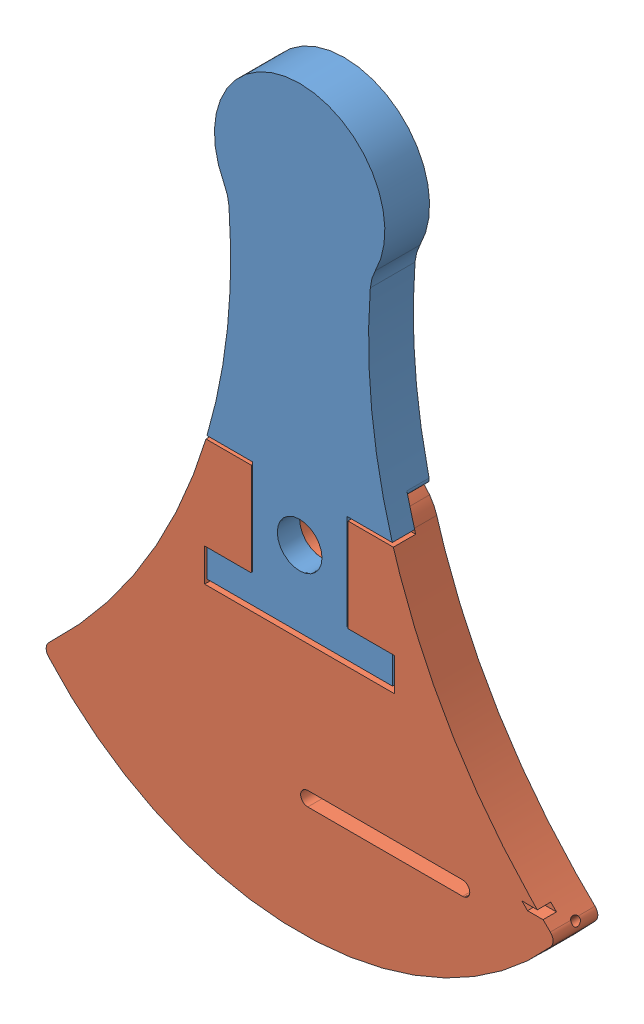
SolidWorks assembly Assem1.sldasm, configuration Default (file format 8000). Lengths in mm.
Overall size (113.37 164.41 10.02).
2 component instances, 2 part files, 2 mates.
Components (placement in the parent):
- Handle_Circle_modified-1: Handle_Circle_modified.SLDPRT [Default] at (24.8916 37.2902 101.8252) size (41.48 106.36 10)
- Hapkit3_0_Sector_modified-2: Hapkit3_0_Sector_modified.SLDPRT [Default] at (24.8916 37.2902 101.8252) size (113.37 98.8 10.02)
Mates (geometry in assembly coordinates):
- Concentric4: concentric aligned: cylinder of Handle_Circle_modified-1 through (24.8916 37.2902 101.8252) axis (0 0 1) radius 5; cylinder of Hapkit3_0_Sector_modified-2 through (24.8916 37.2902 136.9148) axis (0 0 1) radius 5
- Coincident10: coincident anti-aligned: plane of Handle_Circle_modified-1 through (196.7832 113.0478 106.8252) normal (0 0 -1); plane of Hapkit3_0_Sector_modified-2 through (-149.8086 94.0132 106.8252) normal (0 0 1)
